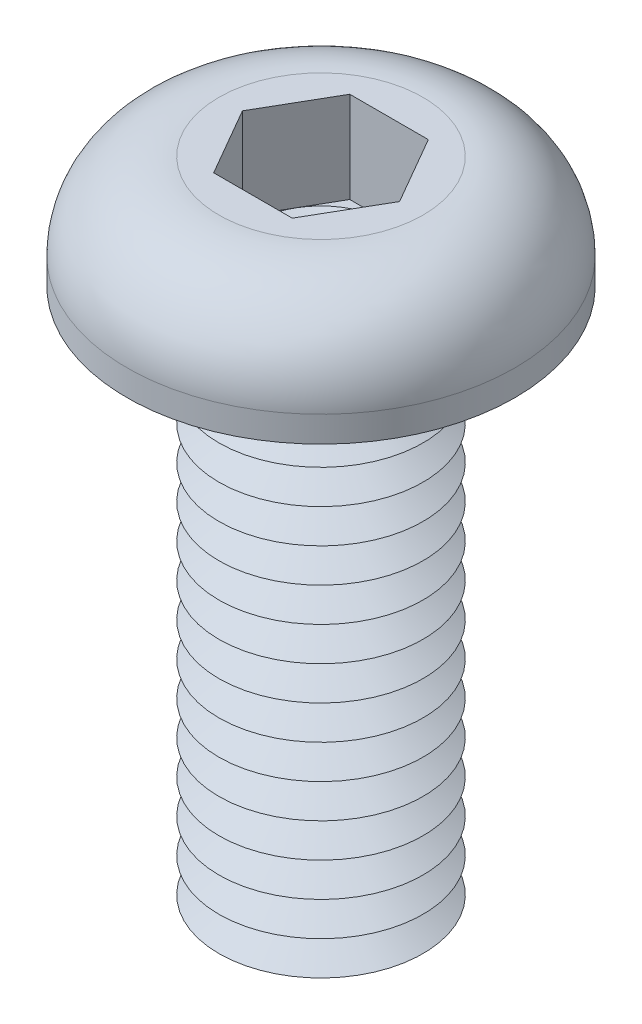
ISO-10303-21;
HEADER;
FILE_DESCRIPTION(('STEP AP214'),'2;1');
FILE_NAME('part.step','',(''),(''),'','','');
FILE_SCHEMA(('AUTOMOTIVE_DESIGN { 1 0 10303 214 1 1 1 1 }'));
ENDSEC;
DATA;
#1=APPLICATION_CONTEXT('core data for automotive mechanical design processes');
#2=APPLICATION_PROTOCOL_DEFINITION('international standard','automotive_design',2000,#1);
#3=PRODUCT_CONTEXT('',#1,'mechanical');
#4=PRODUCT('Part','Part','',(#3));
#5=PRODUCT_RELATED_PRODUCT_CATEGORY('part','',(#4));
#6=PRODUCT_DEFINITION_FORMATION('','',#4);
#7=PRODUCT_DEFINITION_CONTEXT('part definition',#1,'design');
#8=PRODUCT_DEFINITION('design','',#6,#7);
#9=PRODUCT_DEFINITION_SHAPE('','',#8);
#10=(LENGTH_UNIT() NAMED_UNIT(*) SI_UNIT(.MILLI.,.METRE.));
#11=(NAMED_UNIT(*) PLANE_ANGLE_UNIT() SI_UNIT($,.RADIAN.));
#12=(NAMED_UNIT(*) SI_UNIT($,.STERADIAN.) SOLID_ANGLE_UNIT());
#13=UNCERTAINTY_MEASURE_WITH_UNIT(LENGTH_MEASURE(1.E-05),#10,'distance_accuracy_value','');
#14=(GEOMETRIC_REPRESENTATION_CONTEXT(3) GLOBAL_UNCERTAINTY_ASSIGNED_CONTEXT((#13)) GLOBAL_UNIT_ASSIGNED_CONTEXT((#10,
#11,#12)) REPRESENTATION_CONTEXT('',''));
#15=CARTESIAN_POINT('',(0.,0.,0.));
#16=DIRECTION('',(0.,0.,1.));
#17=DIRECTION('',(1.,0.,0.));
#18=AXIS2_PLACEMENT_3D('',#15,#16,#17);
#19=CARTESIAN_POINT('',(0.,0.,0.));
#20=DIRECTION('',(0.,-1.,0.));
#21=DIRECTION('',(0.,0.,-1.));
#22=AXIS2_PLACEMENT_3D('',#19,#20,#21);
#23=TOROIDAL_SURFACE('',#22,1.75,0.25);
#24=CARTESIAN_POINT('',(0.,0.,-2.));
#25=VERTEX_POINT('',#24);
#26=VERTEX_LOOP('',#25);
#27=FACE_BOUND('',#26,.T.);
#28=ADVANCED_FACE('P0_F12',(#27),#23,.T.);
#29=CLOSED_SHELL('',(#28));
#30=MANIFOLD_SOLID_BREP('P0_B1',#29);
#31=CARTESIAN_POINT('',(0.577350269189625,0.31,-1.));
#32=DIRECTION('',(0.,1.,0.));
#33=DIRECTION('',(0.,0.,1.));
#34=AXIS2_PLACEMENT_3D('',#31,#32,#33);
#35=PLANE('',#34);
#36=CARTESIAN_POINT('',(0.,0.31,0.));
#37=DIRECTION('',(0.,1.,0.));
#38=DIRECTION('',(0.,0.,1.));
#39=AXIS2_PLACEMENT_3D('',#36,#37,#38);
#40=CIRCLE('',#39,1.);
#41=CARTESIAN_POINT('',(0.,0.31,1.));
#42=VERTEX_POINT('',#41);
#43=CARTESIAN_POINT('',(0.866025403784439,0.31,0.5));
#44=VERTEX_POINT('',#43);
#45=EDGE_CURVE('P1_E93',#42,#44,#40,.T.);
#46=ORIENTED_EDGE('',*,*,#45,.F.);
#47=DIRECTION('',(1.,0.,0.));
#48=VECTOR('',#47,1.);
#49=CARTESIAN_POINT('',(-0.577350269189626,0.31,1.));
#50=LINE('',#49,#48);
#51=CARTESIAN_POINT('',(0.577350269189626,0.31,1.));
#52=VERTEX_POINT('',#51);
#53=EDGE_CURVE('P1_E116',#42,#52,#50,.T.);
#54=ORIENTED_EDGE('',*,*,#53,.T.);
#55=DIRECTION('',(0.5,0.,-0.866025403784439));
#56=VECTOR('',#55,1.);
#57=CARTESIAN_POINT('',(0.577350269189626,0.31,1.));
#58=LINE('',#57,#56);
#59=EDGE_CURVE('P1_E112',#52,#44,#58,.T.);
#60=ORIENTED_EDGE('',*,*,#59,.T.);
#61=EDGE_LOOP('',(#46,#54,#60));
#62=FACE_BOUND('',#61,.T.);
#63=ADVANCED_FACE('P1_F15',(#62),#35,.T.);
#64=CARTESIAN_POINT('',(0.,0.31,0.));
#65=DIRECTION('',(0.,1.,0.));
#66=DIRECTION('',(0.,0.,1.));
#67=AXIS2_PLACEMENT_3D('',#64,#65,#66);
#68=CIRCLE('',#67,1.);
#69=CARTESIAN_POINT('',(0.866025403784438,0.31,-0.5));
#70=VERTEX_POINT('',#69);
#71=EDGE_CURVE('P1_E10',#44,#70,#68,.T.);
#72=ORIENTED_EDGE('',*,*,#71,.F.);
#73=CARTESIAN_POINT('',(1.15470053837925,0.31,0.));
#74=VERTEX_POINT('',#73);
#75=EDGE_CURVE('P1_E104',#44,#74,#58,.T.);
#76=ORIENTED_EDGE('',*,*,#75,.T.);
#77=DIRECTION('',(-0.5,0.,-0.866025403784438));
#78=VECTOR('',#77,1.);
#79=CARTESIAN_POINT('',(1.15470053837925,0.31,0.));
#80=LINE('',#79,#78);
#81=EDGE_CURVE('P1_E107',#74,#70,#80,.T.);
#82=ORIENTED_EDGE('',*,*,#81,.T.);
#83=EDGE_LOOP('',(#72,#76,#82));
#84=FACE_BOUND('',#83,.T.);
#85=ADVANCED_FACE('P1_F103',(#84),#35,.T.);
#86=CARTESIAN_POINT('',(0.,0.31,-1.));
#87=VERTEX_POINT('',#86);
#88=EDGE_CURVE('P1_E24',#70,#87,#68,.T.);
#89=ORIENTED_EDGE('',*,*,#88,.F.);
#90=CARTESIAN_POINT('',(0.577350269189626,0.31,-1.));
#91=VERTEX_POINT('',#90);
#92=EDGE_CURVE('P1_E139',#70,#91,#80,.T.);
#93=ORIENTED_EDGE('',*,*,#92,.T.);
#94=DIRECTION('',(-1.,0.,0.));
#95=VECTOR('',#94,1.);
#96=CARTESIAN_POINT('',(0.577350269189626,0.31,-1.));
#97=LINE('',#96,#95);
#98=EDGE_CURVE('P1_E312',#91,#87,#97,.T.);
#99=ORIENTED_EDGE('',*,*,#98,.T.);
#100=EDGE_LOOP('',(#89,#93,#99));
#101=FACE_BOUND('',#100,.T.);
#102=ADVANCED_FACE('P1_F277',(#101),#35,.T.);
#103=CARTESIAN_POINT('',(-0.866025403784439,0.31,-0.5));
#104=VERTEX_POINT('',#103);
#105=EDGE_CURVE('P1_E307',#87,#104,#68,.T.);
#106=ORIENTED_EDGE('',*,*,#105,.F.);
#107=CARTESIAN_POINT('',(-0.577350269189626,0.31,-1.));
#108=VERTEX_POINT('',#107);
#109=EDGE_CURVE('P1_E316',#87,#108,#97,.T.);
#110=ORIENTED_EDGE('',*,*,#109,.T.);
#111=DIRECTION('',(-0.5,0.,0.866025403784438));
#112=VECTOR('',#111,1.);
#113=CARTESIAN_POINT('',(-0.577350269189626,0.31,-1.));
#114=LINE('',#113,#112);
#115=EDGE_CURVE('P1_E311',#108,#104,#114,.T.);
#116=ORIENTED_EDGE('',*,*,#115,.T.);
#117=EDGE_LOOP('',(#106,#110,#116));
#118=FACE_BOUND('',#117,.T.);
#119=ADVANCED_FACE('P1_F291',(#118),#35,.T.);
#120=CARTESIAN_POINT('',(-0.866025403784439,0.31,0.5));
#121=VERTEX_POINT('',#120);
#122=EDGE_CURVE('P1_E31',#104,#121,#68,.T.);
#123=ORIENTED_EDGE('',*,*,#122,.F.);
#124=CARTESIAN_POINT('',(-1.15470053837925,0.31,0.));
#125=VERTEX_POINT('',#124);
#126=EDGE_CURVE('P1_E303',#104,#125,#114,.T.);
#127=ORIENTED_EDGE('',*,*,#126,.T.);
#128=DIRECTION('',(0.5,0.,0.866025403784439));
#129=VECTOR('',#128,1.);
#130=CARTESIAN_POINT('',(-1.15470053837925,0.31,0.));
#131=LINE('',#130,#129);
#132=EDGE_CURVE('P1_E306',#125,#121,#131,.T.);
#133=ORIENTED_EDGE('',*,*,#132,.T.);
#134=EDGE_LOOP('',(#123,#127,#133));
#135=FACE_BOUND('',#134,.T.);
#136=ADVANCED_FACE('P1_F282',(#135),#35,.T.);
#137=CARTESIAN_POINT('',(0.,-7.5,0.));
#138=DIRECTION('',(0.,1.,0.));
#139=DIRECTION('',(0.,0.,1.));
#140=AXIS2_PLACEMENT_3D('',#137,#138,#139);
#141=CONICAL_SURFACE('',#140,1.06698729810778,1.0471975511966);
#142=CARTESIAN_POINT('',(0.,-7.25,0.));
#143=DIRECTION('',(0.,-1.,0.));
#144=DIRECTION('',(0.,0.,-1.));
#145=AXIS2_PLACEMENT_3D('',#142,#143,#144);
#146=CIRCLE('',#145,1.5);
#147=CARTESIAN_POINT('',(0.,-7.25,-1.5));
#148=VERTEX_POINT('',#147);
#149=EDGE_CURVE('P1_E239',#148,#148,#146,.T.);
#150=ORIENTED_EDGE('',*,*,#149,.T.);
#151=EDGE_LOOP('',(#150));
#152=FACE_BOUND('',#151,.T.);
#153=CARTESIAN_POINT('',(0.,-7.5,0.));
#154=DIRECTION('',(0.,-1.,0.));
#155=DIRECTION('',(0.,0.,-1.));
#156=AXIS2_PLACEMENT_3D('',#153,#154,#155);
#157=CIRCLE('',#156,1.06698729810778);
#158=CARTESIAN_POINT('',(0.,-7.5,-1.06698729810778));
#159=VERTEX_POINT('',#158);
#160=EDGE_CURVE('P1_E242',#159,#159,#157,.T.);
#161=ORIENTED_EDGE('',*,*,#160,.F.);
#162=EDGE_LOOP('',(#161));
#163=FACE_BOUND('',#162,.T.);
#164=ADVANCED_FACE('P1_F290',(#152,#163),#141,.T.);
#165=CARTESIAN_POINT('',(0.,-7.75,0.));
#166=DIRECTION('',(0.,-1.,0.));
#167=DIRECTION('',(0.,0.,-1.));
#168=AXIS2_PLACEMENT_3D('',#165,#166,#167);
#169=CONICAL_SURFACE('',#168,1.5,1.0471975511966);
#170=ORIENTED_EDGE('',*,*,#160,.T.);
#171=EDGE_LOOP('',(#170));
#172=FACE_BOUND('',#171,.T.);
#173=CARTESIAN_POINT('',(0.,-7.75,0.));
#174=DIRECTION('',(0.,-1.,0.));
#175=DIRECTION('',(0.,0.,-1.));
#176=AXIS2_PLACEMENT_3D('',#173,#174,#175);
#177=CIRCLE('',#176,1.5);
#178=CARTESIAN_POINT('',(0.,-7.75,-1.5));
#179=VERTEX_POINT('',#178);
#180=EDGE_CURVE('P1_E245',#179,#179,#177,.T.);
#181=ORIENTED_EDGE('',*,*,#180,.F.);
#182=EDGE_LOOP('',(#181));
#183=FACE_BOUND('',#182,.T.);
#184=ADVANCED_FACE('P1_F297',(#172,#183),#169,.T.);
#185=CARTESIAN_POINT('',(0.,-8.,0.));
#186=DIRECTION('',(0.,1.,0.));
#187=DIRECTION('',(0.,0.,1.));
#188=AXIS2_PLACEMENT_3D('',#185,#186,#187);
#189=PLANE('',#188);
#190=CARTESIAN_POINT('',(0.,-8.,0.));
#191=DIRECTION('',(0.,-1.,0.));
#192=DIRECTION('',(0.,0.,-1.));
#193=AXIS2_PLACEMENT_3D('',#190,#191,#192);
#194=CIRCLE('',#193,1.06698729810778);
#195=CARTESIAN_POINT('',(0.,-8.,-1.06698729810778));
#196=VERTEX_POINT('',#195);
#197=EDGE_CURVE('P1_E248',#196,#196,#194,.T.);
#198=ORIENTED_EDGE('',*,*,#197,.T.);
#199=EDGE_LOOP('',(#198));
#200=FACE_BOUND('',#199,.T.);
#201=ADVANCED_FACE('P1_F375',(#200),#189,.F.);
#202=CARTESIAN_POINT('',(0.,-8.,0.));
#203=DIRECTION('',(0.,1.,0.));
#204=DIRECTION('',(0.,0.,1.));
#205=AXIS2_PLACEMENT_3D('',#202,#203,#204);
#206=CONICAL_SURFACE('',#205,1.06698729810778,1.0471975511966);
#207=ORIENTED_EDGE('',*,*,#180,.T.);
#208=EDGE_LOOP('',(#207));
#209=FACE_BOUND('',#208,.T.);
#210=ORIENTED_EDGE('',*,*,#197,.F.);
#211=EDGE_LOOP('',(#210));
#212=FACE_BOUND('',#211,.T.);
#213=ADVANCED_FACE('P1_F386',(#209,#212),#206,.T.);
#214=CARTESIAN_POINT('',(0.,-7.,0.));
#215=DIRECTION('',(0.,1.,0.));
#216=DIRECTION('',(0.,0.,1.));
#217=AXIS2_PLACEMENT_3D('',#214,#215,#216);
#218=CONICAL_SURFACE('',#217,1.06698729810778,1.0471975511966);
#219=CARTESIAN_POINT('',(0.,-6.75,0.));
#220=DIRECTION('',(0.,-1.,0.));
#221=DIRECTION('',(0.,0.,-1.));
#222=AXIS2_PLACEMENT_3D('',#219,#220,#221);
#223=CIRCLE('',#222,1.5);
#224=CARTESIAN_POINT('',(0.,-6.75,-1.5));
#225=VERTEX_POINT('',#224);
#226=EDGE_CURVE('P1_E233',#225,#225,#223,.T.);
#227=ORIENTED_EDGE('',*,*,#226,.T.);
#228=EDGE_LOOP('',(#227));
#229=FACE_BOUND('',#228,.T.);
#230=CARTESIAN_POINT('',(0.,-7.,0.));
#231=DIRECTION('',(0.,-1.,0.));
#232=DIRECTION('',(0.,0.,-1.));
#233=AXIS2_PLACEMENT_3D('',#230,#231,#232);
#234=CIRCLE('',#233,1.06698729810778);
#235=CARTESIAN_POINT('',(0.,-7.,-1.06698729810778));
#236=VERTEX_POINT('',#235);
#237=EDGE_CURVE('P1_E236',#236,#236,#234,.T.);
#238=ORIENTED_EDGE('',*,*,#237,.F.);
#239=EDGE_LOOP('',(#238));
#240=FACE_BOUND('',#239,.T.);
#241=ADVANCED_FACE('P1_F395',(#229,#240),#218,.T.);
#242=CARTESIAN_POINT('',(0.,-7.25,0.));
#243=DIRECTION('',(0.,-1.,0.));
#244=DIRECTION('',(0.,0.,-1.));
#245=AXIS2_PLACEMENT_3D('',#242,#243,#244);
#246=CONICAL_SURFACE('',#245,1.5,1.0471975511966);
#247=ORIENTED_EDGE('',*,*,#237,.T.);
#248=EDGE_LOOP('',(#247));
#249=FACE_BOUND('',#248,.T.);
#250=ORIENTED_EDGE('',*,*,#149,.F.);
#251=EDGE_LOOP('',(#250));
#252=FACE_BOUND('',#251,.T.);
#253=ADVANCED_FACE('P1_F404',(#249,#252),#246,.T.);
#254=CARTESIAN_POINT('',(0.,-6.5,0.));
#255=DIRECTION('',(0.,1.,0.));
#256=DIRECTION('',(0.,0.,1.));
#257=AXIS2_PLACEMENT_3D('',#254,#255,#256);
#258=CONICAL_SURFACE('',#257,1.06698729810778,1.0471975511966);
#259=CARTESIAN_POINT('',(0.,-6.25,0.));
#260=DIRECTION('',(0.,-1.,0.));
#261=DIRECTION('',(0.,0.,-1.));
#262=AXIS2_PLACEMENT_3D('',#259,#260,#261);
#263=CIRCLE('',#262,1.5);
#264=CARTESIAN_POINT('',(0.,-6.25,-1.5));
#265=VERTEX_POINT('',#264);
#266=EDGE_CURVE('P1_E227',#265,#265,#263,.T.);
#267=ORIENTED_EDGE('',*,*,#266,.T.);
#268=EDGE_LOOP('',(#267));
#269=FACE_BOUND('',#268,.T.);
#270=CARTESIAN_POINT('',(0.,-6.5,0.));
#271=DIRECTION('',(0.,-1.,0.));
#272=DIRECTION('',(0.,0.,-1.));
#273=AXIS2_PLACEMENT_3D('',#270,#271,#272);
#274=CIRCLE('',#273,1.06698729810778);
#275=CARTESIAN_POINT('',(0.,-6.5,-1.06698729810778));
#276=VERTEX_POINT('',#275);
#277=EDGE_CURVE('P1_E230',#276,#276,#274,.T.);
#278=ORIENTED_EDGE('',*,*,#277,.F.);
#279=EDGE_LOOP('',(#278));
#280=FACE_BOUND('',#279,.T.);
#281=ADVANCED_FACE('P1_F414',(#269,#280),#258,.T.);
#282=CARTESIAN_POINT('',(0.,-6.75,0.));
#283=DIRECTION('',(0.,-1.,0.));
#284=DIRECTION('',(0.,0.,-1.));
#285=AXIS2_PLACEMENT_3D('',#282,#283,#284);
#286=CONICAL_SURFACE('',#285,1.5,1.0471975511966);
#287=ORIENTED_EDGE('',*,*,#277,.T.);
#288=EDGE_LOOP('',(#287));
#289=FACE_BOUND('',#288,.T.);
#290=ORIENTED_EDGE('',*,*,#226,.F.);
#291=EDGE_LOOP('',(#290));
#292=FACE_BOUND('',#291,.T.);
#293=ADVANCED_FACE('P1_F424',(#289,#292),#286,.T.);
#294=CARTESIAN_POINT('',(0.,-6.,0.));
#295=DIRECTION('',(0.,1.,0.));
#296=DIRECTION('',(0.,0.,1.));
#297=AXIS2_PLACEMENT_3D('',#294,#295,#296);
#298=CONICAL_SURFACE('',#297,1.06698729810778,1.0471975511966);
#299=CARTESIAN_POINT('',(0.,-5.75,0.));
#300=DIRECTION('',(0.,-1.,0.));
#301=DIRECTION('',(0.,0.,-1.));
#302=AXIS2_PLACEMENT_3D('',#299,#300,#301);
#303=CIRCLE('',#302,1.5);
#304=CARTESIAN_POINT('',(0.,-5.75,-1.5));
#305=VERTEX_POINT('',#304);
#306=EDGE_CURVE('P1_E221',#305,#305,#303,.T.);
#307=ORIENTED_EDGE('',*,*,#306,.T.);
#308=EDGE_LOOP('',(#307));
#309=FACE_BOUND('',#308,.T.);
#310=CARTESIAN_POINT('',(0.,-6.,0.));
#311=DIRECTION('',(0.,-1.,0.));
#312=DIRECTION('',(0.,0.,-1.));
#313=AXIS2_PLACEMENT_3D('',#310,#311,#312);
#314=CIRCLE('',#313,1.06698729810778);
#315=CARTESIAN_POINT('',(0.,-6.,-1.06698729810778));
#316=VERTEX_POINT('',#315);
#317=EDGE_CURVE('P1_E224',#316,#316,#314,.T.);
#318=ORIENTED_EDGE('',*,*,#317,.F.);
#319=EDGE_LOOP('',(#318));
#320=FACE_BOUND('',#319,.T.);
#321=ADVANCED_FACE('P1_F434',(#309,#320),#298,.T.);
#322=CARTESIAN_POINT('',(0.,-6.25,0.));
#323=DIRECTION('',(0.,-1.,0.));
#324=DIRECTION('',(0.,0.,-1.));
#325=AXIS2_PLACEMENT_3D('',#322,#323,#324);
#326=CONICAL_SURFACE('',#325,1.5,1.0471975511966);
#327=ORIENTED_EDGE('',*,*,#317,.T.);
#328=EDGE_LOOP('',(#327));
#329=FACE_BOUND('',#328,.T.);
#330=ORIENTED_EDGE('',*,*,#266,.F.);
#331=EDGE_LOOP('',(#330));
#332=FACE_BOUND('',#331,.T.);
#333=ADVANCED_FACE('P1_F444',(#329,#332),#326,.T.);
#334=CARTESIAN_POINT('',(0.,-5.5,0.));
#335=DIRECTION('',(0.,1.,0.));
#336=DIRECTION('',(0.,0.,1.));
#337=AXIS2_PLACEMENT_3D('',#334,#335,#336);
#338=CONICAL_SURFACE('',#337,1.06698729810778,1.0471975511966);
#339=CARTESIAN_POINT('',(0.,-5.25,0.));
#340=DIRECTION('',(0.,-1.,0.));
#341=DIRECTION('',(0.,0.,-1.));
#342=AXIS2_PLACEMENT_3D('',#339,#340,#341);
#343=CIRCLE('',#342,1.5);
#344=CARTESIAN_POINT('',(0.,-5.25,-1.5));
#345=VERTEX_POINT('',#344);
#346=EDGE_CURVE('P1_E215',#345,#345,#343,.T.);
#347=ORIENTED_EDGE('',*,*,#346,.T.);
#348=EDGE_LOOP('',(#347));
#349=FACE_BOUND('',#348,.T.);
#350=CARTESIAN_POINT('',(0.,-5.5,0.));
#351=DIRECTION('',(0.,-1.,0.));
#352=DIRECTION('',(0.,0.,-1.));
#353=AXIS2_PLACEMENT_3D('',#350,#351,#352);
#354=CIRCLE('',#353,1.06698729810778);
#355=CARTESIAN_POINT('',(0.,-5.5,-1.06698729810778));
#356=VERTEX_POINT('',#355);
#357=EDGE_CURVE('P1_E218',#356,#356,#354,.T.);
#358=ORIENTED_EDGE('',*,*,#357,.F.);
#359=EDGE_LOOP('',(#358));
#360=FACE_BOUND('',#359,.T.);
#361=ADVANCED_FACE('P1_F454',(#349,#360),#338,.T.);
#362=CARTESIAN_POINT('',(0.,-5.75,0.));
#363=DIRECTION('',(0.,-1.,0.));
#364=DIRECTION('',(0.,0.,-1.));
#365=AXIS2_PLACEMENT_3D('',#362,#363,#364);
#366=CONICAL_SURFACE('',#365,1.5,1.0471975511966);
#367=ORIENTED_EDGE('',*,*,#357,.T.);
#368=EDGE_LOOP('',(#367));
#369=FACE_BOUND('',#368,.T.);
#370=ORIENTED_EDGE('',*,*,#306,.F.);
#371=EDGE_LOOP('',(#370));
#372=FACE_BOUND('',#371,.T.);
#373=ADVANCED_FACE('P1_F464',(#369,#372),#366,.T.);
#374=CARTESIAN_POINT('',(0.,-5.,0.));
#375=DIRECTION('',(0.,1.,0.));
#376=DIRECTION('',(0.,0.,1.));
#377=AXIS2_PLACEMENT_3D('',#374,#375,#376);
#378=CONICAL_SURFACE('',#377,1.06698729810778,1.0471975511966);
#379=CARTESIAN_POINT('',(0.,-4.75,0.));
#380=DIRECTION('',(0.,-1.,0.));
#381=DIRECTION('',(0.,0.,-1.));
#382=AXIS2_PLACEMENT_3D('',#379,#380,#381);
#383=CIRCLE('',#382,1.5);
#384=CARTESIAN_POINT('',(0.,-4.75,-1.5));
#385=VERTEX_POINT('',#384);
#386=EDGE_CURVE('P1_E209',#385,#385,#383,.T.);
#387=ORIENTED_EDGE('',*,*,#386,.T.);
#388=EDGE_LOOP('',(#387));
#389=FACE_BOUND('',#388,.T.);
#390=CARTESIAN_POINT('',(0.,-5.,0.));
#391=DIRECTION('',(0.,-1.,0.));
#392=DIRECTION('',(0.,0.,-1.));
#393=AXIS2_PLACEMENT_3D('',#390,#391,#392);
#394=CIRCLE('',#393,1.06698729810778);
#395=CARTESIAN_POINT('',(0.,-5.,-1.06698729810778));
#396=VERTEX_POINT('',#395);
#397=EDGE_CURVE('P1_E212',#396,#396,#394,.T.);
#398=ORIENTED_EDGE('',*,*,#397,.F.);
#399=EDGE_LOOP('',(#398));
#400=FACE_BOUND('',#399,.T.);
#401=ADVANCED_FACE('P1_F474',(#389,#400),#378,.T.);
#402=CARTESIAN_POINT('',(0.,-5.25,0.));
#403=DIRECTION('',(0.,-1.,0.));
#404=DIRECTION('',(0.,0.,-1.));
#405=AXIS2_PLACEMENT_3D('',#402,#403,#404);
#406=CONICAL_SURFACE('',#405,1.5,1.0471975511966);
#407=ORIENTED_EDGE('',*,*,#397,.T.);
#408=EDGE_LOOP('',(#407));
#409=FACE_BOUND('',#408,.T.);
#410=ORIENTED_EDGE('',*,*,#346,.F.);
#411=EDGE_LOOP('',(#410));
#412=FACE_BOUND('',#411,.T.);
#413=ADVANCED_FACE('P1_F484',(#409,#412),#406,.T.);
#414=CARTESIAN_POINT('',(0.,-4.5,0.));
#415=DIRECTION('',(0.,1.,0.));
#416=DIRECTION('',(0.,0.,1.));
#417=AXIS2_PLACEMENT_3D('',#414,#415,#416);
#418=CONICAL_SURFACE('',#417,1.06698729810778,1.0471975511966);
#419=CARTESIAN_POINT('',(0.,-4.25,0.));
#420=DIRECTION('',(0.,-1.,0.));
#421=DIRECTION('',(0.,0.,-1.));
#422=AXIS2_PLACEMENT_3D('',#419,#420,#421);
#423=CIRCLE('',#422,1.5);
#424=CARTESIAN_POINT('',(0.,-4.25,-1.5));
#425=VERTEX_POINT('',#424);
#426=EDGE_CURVE('P1_E203',#425,#425,#423,.T.);
#427=ORIENTED_EDGE('',*,*,#426,.T.);
#428=EDGE_LOOP('',(#427));
#429=FACE_BOUND('',#428,.T.);
#430=CARTESIAN_POINT('',(0.,-4.5,0.));
#431=DIRECTION('',(0.,-1.,0.));
#432=DIRECTION('',(0.,0.,-1.));
#433=AXIS2_PLACEMENT_3D('',#430,#431,#432);
#434=CIRCLE('',#433,1.06698729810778);
#435=CARTESIAN_POINT('',(0.,-4.5,-1.06698729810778));
#436=VERTEX_POINT('',#435);
#437=EDGE_CURVE('P1_E206',#436,#436,#434,.T.);
#438=ORIENTED_EDGE('',*,*,#437,.F.);
#439=EDGE_LOOP('',(#438));
#440=FACE_BOUND('',#439,.T.);
#441=ADVANCED_FACE('P1_F494',(#429,#440),#418,.T.);
#442=CARTESIAN_POINT('',(0.,-4.75,0.));
#443=DIRECTION('',(0.,-1.,0.));
#444=DIRECTION('',(0.,0.,-1.));
#445=AXIS2_PLACEMENT_3D('',#442,#443,#444);
#446=CONICAL_SURFACE('',#445,1.5,1.0471975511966);
#447=ORIENTED_EDGE('',*,*,#437,.T.);
#448=EDGE_LOOP('',(#447));
#449=FACE_BOUND('',#448,.T.);
#450=ORIENTED_EDGE('',*,*,#386,.F.);
#451=EDGE_LOOP('',(#450));
#452=FACE_BOUND('',#451,.T.);
#453=ADVANCED_FACE('P1_F504',(#449,#452),#446,.T.);
#454=CARTESIAN_POINT('',(0.,-4.,0.));
#455=DIRECTION('',(0.,1.,0.));
#456=DIRECTION('',(0.,0.,1.));
#457=AXIS2_PLACEMENT_3D('',#454,#455,#456);
#458=CONICAL_SURFACE('',#457,1.06698729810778,1.0471975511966);
#459=CARTESIAN_POINT('',(0.,-3.75,0.));
#460=DIRECTION('',(0.,-1.,0.));
#461=DIRECTION('',(0.,0.,-1.));
#462=AXIS2_PLACEMENT_3D('',#459,#460,#461);
#463=CIRCLE('',#462,1.5);
#464=CARTESIAN_POINT('',(0.,-3.75,-1.5));
#465=VERTEX_POINT('',#464);
#466=EDGE_CURVE('P1_E197',#465,#465,#463,.T.);
#467=ORIENTED_EDGE('',*,*,#466,.T.);
#468=EDGE_LOOP('',(#467));
#469=FACE_BOUND('',#468,.T.);
#470=CARTESIAN_POINT('',(0.,-4.,0.));
#471=DIRECTION('',(0.,-1.,0.));
#472=DIRECTION('',(0.,0.,-1.));
#473=AXIS2_PLACEMENT_3D('',#470,#471,#472);
#474=CIRCLE('',#473,1.06698729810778);
#475=CARTESIAN_POINT('',(0.,-4.,-1.06698729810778));
#476=VERTEX_POINT('',#475);
#477=EDGE_CURVE('P1_E200',#476,#476,#474,.T.);
#478=ORIENTED_EDGE('',*,*,#477,.F.);
#479=EDGE_LOOP('',(#478));
#480=FACE_BOUND('',#479,.T.);
#481=ADVANCED_FACE('P1_F514',(#469,#480),#458,.T.);
#482=CARTESIAN_POINT('',(0.,-4.25,0.));
#483=DIRECTION('',(0.,-1.,0.));
#484=DIRECTION('',(0.,0.,-1.));
#485=AXIS2_PLACEMENT_3D('',#482,#483,#484);
#486=CONICAL_SURFACE('',#485,1.5,1.0471975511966);
#487=ORIENTED_EDGE('',*,*,#477,.T.);
#488=EDGE_LOOP('',(#487));
#489=FACE_BOUND('',#488,.T.);
#490=ORIENTED_EDGE('',*,*,#426,.F.);
#491=EDGE_LOOP('',(#490));
#492=FACE_BOUND('',#491,.T.);
#493=ADVANCED_FACE('P1_F524',(#489,#492),#486,.T.);
#494=CARTESIAN_POINT('',(0.,-3.5,0.));
#495=DIRECTION('',(0.,1.,0.));
#496=DIRECTION('',(0.,0.,1.));
#497=AXIS2_PLACEMENT_3D('',#494,#495,#496);
#498=CONICAL_SURFACE('',#497,1.06698729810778,1.0471975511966);
#499=CARTESIAN_POINT('',(0.,-3.25,0.));
#500=DIRECTION('',(0.,-1.,0.));
#501=DIRECTION('',(0.,0.,-1.));
#502=AXIS2_PLACEMENT_3D('',#499,#500,#501);
#503=CIRCLE('',#502,1.5);
#504=CARTESIAN_POINT('',(0.,-3.25,-1.5));
#505=VERTEX_POINT('',#504);
#506=EDGE_CURVE('P1_E191',#505,#505,#503,.T.);
#507=ORIENTED_EDGE('',*,*,#506,.T.);
#508=EDGE_LOOP('',(#507));
#509=FACE_BOUND('',#508,.T.);
#510=CARTESIAN_POINT('',(0.,-3.5,0.));
#511=DIRECTION('',(0.,-1.,0.));
#512=DIRECTION('',(0.,0.,-1.));
#513=AXIS2_PLACEMENT_3D('',#510,#511,#512);
#514=CIRCLE('',#513,1.06698729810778);
#515=CARTESIAN_POINT('',(0.,-3.5,-1.06698729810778));
#516=VERTEX_POINT('',#515);
#517=EDGE_CURVE('P1_E194',#516,#516,#514,.T.);
#518=ORIENTED_EDGE('',*,*,#517,.F.);
#519=EDGE_LOOP('',(#518));
#520=FACE_BOUND('',#519,.T.);
#521=ADVANCED_FACE('P1_F534',(#509,#520),#498,.T.);
#522=CARTESIAN_POINT('',(0.,-3.75,0.));
#523=DIRECTION('',(0.,-1.,0.));
#524=DIRECTION('',(0.,0.,-1.));
#525=AXIS2_PLACEMENT_3D('',#522,#523,#524);
#526=CONICAL_SURFACE('',#525,1.5,1.0471975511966);
#527=ORIENTED_EDGE('',*,*,#517,.T.);
#528=EDGE_LOOP('',(#527));
#529=FACE_BOUND('',#528,.T.);
#530=ORIENTED_EDGE('',*,*,#466,.F.);
#531=EDGE_LOOP('',(#530));
#532=FACE_BOUND('',#531,.T.);
#533=ADVANCED_FACE('P1_F544',(#529,#532),#526,.T.);
#534=CARTESIAN_POINT('',(0.,-3.,0.));
#535=DIRECTION('',(0.,1.,0.));
#536=DIRECTION('',(0.,0.,1.));
#537=AXIS2_PLACEMENT_3D('',#534,#535,#536);
#538=CONICAL_SURFACE('',#537,1.06698729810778,1.0471975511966);
#539=CARTESIAN_POINT('',(0.,-2.75,0.));
#540=DIRECTION('',(0.,-1.,0.));
#541=DIRECTION('',(0.,0.,-1.));
#542=AXIS2_PLACEMENT_3D('',#539,#540,#541);
#543=CIRCLE('',#542,1.5);
#544=CARTESIAN_POINT('',(0.,-2.75,-1.5));
#545=VERTEX_POINT('',#544);
#546=EDGE_CURVE('P1_E185',#545,#545,#543,.T.);
#547=ORIENTED_EDGE('',*,*,#546,.T.);
#548=EDGE_LOOP('',(#547));
#549=FACE_BOUND('',#548,.T.);
#550=CARTESIAN_POINT('',(0.,-3.,0.));
#551=DIRECTION('',(0.,-1.,0.));
#552=DIRECTION('',(0.,0.,-1.));
#553=AXIS2_PLACEMENT_3D('',#550,#551,#552);
#554=CIRCLE('',#553,1.06698729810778);
#555=CARTESIAN_POINT('',(0.,-3.,-1.06698729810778));
#556=VERTEX_POINT('',#555);
#557=EDGE_CURVE('P1_E188',#556,#556,#554,.T.);
#558=ORIENTED_EDGE('',*,*,#557,.F.);
#559=EDGE_LOOP('',(#558));
#560=FACE_BOUND('',#559,.T.);
#561=ADVANCED_FACE('P1_F554',(#549,#560),#538,.T.);
#562=CARTESIAN_POINT('',(0.,-3.25,0.));
#563=DIRECTION('',(0.,-1.,0.));
#564=DIRECTION('',(0.,0.,-1.));
#565=AXIS2_PLACEMENT_3D('',#562,#563,#564);
#566=CONICAL_SURFACE('',#565,1.5,1.0471975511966);
#567=ORIENTED_EDGE('',*,*,#557,.T.);
#568=EDGE_LOOP('',(#567));
#569=FACE_BOUND('',#568,.T.);
#570=ORIENTED_EDGE('',*,*,#506,.F.);
#571=EDGE_LOOP('',(#570));
#572=FACE_BOUND('',#571,.T.);
#573=ADVANCED_FACE('P1_F564',(#569,#572),#566,.T.);
#574=CARTESIAN_POINT('',(0.,-2.5,0.));
#575=DIRECTION('',(0.,1.,0.));
#576=DIRECTION('',(0.,0.,1.));
#577=AXIS2_PLACEMENT_3D('',#574,#575,#576);
#578=CONICAL_SURFACE('',#577,1.06698729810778,1.0471975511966);
#579=CARTESIAN_POINT('',(0.,-2.25,0.));
#580=DIRECTION('',(0.,-1.,0.));
#581=DIRECTION('',(0.,0.,-1.));
#582=AXIS2_PLACEMENT_3D('',#579,#580,#581);
#583=CIRCLE('',#582,1.5);
#584=CARTESIAN_POINT('',(0.,-2.25,-1.5));
#585=VERTEX_POINT('',#584);
#586=EDGE_CURVE('P1_E179',#585,#585,#583,.T.);
#587=ORIENTED_EDGE('',*,*,#586,.T.);
#588=EDGE_LOOP('',(#587));
#589=FACE_BOUND('',#588,.T.);
#590=CARTESIAN_POINT('',(0.,-2.5,0.));
#591=DIRECTION('',(0.,-1.,0.));
#592=DIRECTION('',(0.,0.,-1.));
#593=AXIS2_PLACEMENT_3D('',#590,#591,#592);
#594=CIRCLE('',#593,1.06698729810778);
#595=CARTESIAN_POINT('',(0.,-2.5,-1.06698729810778));
#596=VERTEX_POINT('',#595);
#597=EDGE_CURVE('P1_E182',#596,#596,#594,.T.);
#598=ORIENTED_EDGE('',*,*,#597,.F.);
#599=EDGE_LOOP('',(#598));
#600=FACE_BOUND('',#599,.T.);
#601=ADVANCED_FACE('P1_F574',(#589,#600),#578,.T.);
#602=CARTESIAN_POINT('',(0.,-2.75,0.));
#603=DIRECTION('',(0.,-1.,0.));
#604=DIRECTION('',(0.,0.,-1.));
#605=AXIS2_PLACEMENT_3D('',#602,#603,#604);
#606=CONICAL_SURFACE('',#605,1.5,1.0471975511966);
#607=ORIENTED_EDGE('',*,*,#597,.T.);
#608=EDGE_LOOP('',(#607));
#609=FACE_BOUND('',#608,.T.);
#610=ORIENTED_EDGE('',*,*,#546,.F.);
#611=EDGE_LOOP('',(#610));
#612=FACE_BOUND('',#611,.T.);
#613=ADVANCED_FACE('P1_F584',(#609,#612),#606,.T.);
#614=CARTESIAN_POINT('',(0.,-2.,0.));
#615=DIRECTION('',(0.,1.,0.));
#616=DIRECTION('',(0.,0.,1.));
#617=AXIS2_PLACEMENT_3D('',#614,#615,#616);
#618=CONICAL_SURFACE('',#617,1.06698729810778,1.0471975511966);
#619=CARTESIAN_POINT('',(0.,-1.75,0.));
#620=DIRECTION('',(0.,-1.,0.));
#621=DIRECTION('',(0.,0.,-1.));
#622=AXIS2_PLACEMENT_3D('',#619,#620,#621);
#623=CIRCLE('',#622,1.5);
#624=CARTESIAN_POINT('',(0.,-1.75,-1.5));
#625=VERTEX_POINT('',#624);
#626=EDGE_CURVE('P1_E173',#625,#625,#623,.T.);
#627=ORIENTED_EDGE('',*,*,#626,.T.);
#628=EDGE_LOOP('',(#627));
#629=FACE_BOUND('',#628,.T.);
#630=CARTESIAN_POINT('',(0.,-2.,0.));
#631=DIRECTION('',(0.,-1.,0.));
#632=DIRECTION('',(0.,0.,-1.));
#633=AXIS2_PLACEMENT_3D('',#630,#631,#632);
#634=CIRCLE('',#633,1.06698729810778);
#635=CARTESIAN_POINT('',(0.,-2.,-1.06698729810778));
#636=VERTEX_POINT('',#635);
#637=EDGE_CURVE('P1_E176',#636,#636,#634,.T.);
#638=ORIENTED_EDGE('',*,*,#637,.F.);
#639=EDGE_LOOP('',(#638));
#640=FACE_BOUND('',#639,.T.);
#641=ADVANCED_FACE('P1_F594',(#629,#640),#618,.T.);
#642=CARTESIAN_POINT('',(0.,-2.25,0.));
#643=DIRECTION('',(0.,-1.,0.));
#644=DIRECTION('',(0.,0.,-1.));
#645=AXIS2_PLACEMENT_3D('',#642,#643,#644);
#646=CONICAL_SURFACE('',#645,1.5,1.0471975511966);
#647=ORIENTED_EDGE('',*,*,#637,.T.);
#648=EDGE_LOOP('',(#647));
#649=FACE_BOUND('',#648,.T.);
#650=ORIENTED_EDGE('',*,*,#586,.F.);
#651=EDGE_LOOP('',(#650));
#652=FACE_BOUND('',#651,.T.);
#653=ADVANCED_FACE('P1_F604',(#649,#652),#646,.T.);
#654=CARTESIAN_POINT('',(0.,-1.5,0.));
#655=DIRECTION('',(0.,1.,0.));
#656=DIRECTION('',(0.,0.,1.));
#657=AXIS2_PLACEMENT_3D('',#654,#655,#656);
#658=CONICAL_SURFACE('',#657,1.06698729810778,1.0471975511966);
#659=CARTESIAN_POINT('',(0.,-1.25,0.));
#660=DIRECTION('',(0.,-1.,0.));
#661=DIRECTION('',(0.,0.,-1.));
#662=AXIS2_PLACEMENT_3D('',#659,#660,#661);
#663=CIRCLE('',#662,1.5);
#664=CARTESIAN_POINT('',(0.,-1.25,-1.5));
#665=VERTEX_POINT('',#664);
#666=EDGE_CURVE('P1_E164',#665,#665,#663,.T.);
#667=ORIENTED_EDGE('',*,*,#666,.T.);
#668=EDGE_LOOP('',(#667));
#669=FACE_BOUND('',#668,.T.);
#670=CARTESIAN_POINT('',(0.,-1.5,0.));
#671=DIRECTION('',(0.,-1.,0.));
#672=DIRECTION('',(0.,0.,-1.));
#673=AXIS2_PLACEMENT_3D('',#670,#671,#672);
#674=CIRCLE('',#673,1.06698729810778);
#675=CARTESIAN_POINT('',(0.,-1.5,-1.06698729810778));
#676=VERTEX_POINT('',#675);
#677=EDGE_CURVE('P1_E170',#676,#676,#674,.T.);
#678=ORIENTED_EDGE('',*,*,#677,.F.);
#679=EDGE_LOOP('',(#678));
#680=FACE_BOUND('',#679,.T.);
#681=ADVANCED_FACE('P1_F614',(#669,#680),#658,.T.);
#682=CARTESIAN_POINT('',(0.,-1.75,0.));
#683=DIRECTION('',(0.,-1.,0.));
#684=DIRECTION('',(0.,0.,-1.));
#685=AXIS2_PLACEMENT_3D('',#682,#683,#684);
#686=CONICAL_SURFACE('',#685,1.5,1.0471975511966);
#687=ORIENTED_EDGE('',*,*,#677,.T.);
#688=EDGE_LOOP('',(#687));
#689=FACE_BOUND('',#688,.T.);
#690=ORIENTED_EDGE('',*,*,#626,.F.);
#691=EDGE_LOOP('',(#690));
#692=FACE_BOUND('',#691,.T.);
#693=ADVANCED_FACE('P1_F624',(#689,#692),#686,.T.);
#694=CARTESIAN_POINT('',(0.,-1.,0.));
#695=DIRECTION('',(0.,1.,0.));
#696=DIRECTION('',(0.,0.,1.));
#697=AXIS2_PLACEMENT_3D('',#694,#695,#696);
#698=CONICAL_SURFACE('',#697,1.06698729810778,1.0471975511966);
#699=CARTESIAN_POINT('',(0.,-0.75,0.));
#700=DIRECTION('',(0.,-1.,0.));
#701=DIRECTION('',(0.,0.,-1.));
#702=AXIS2_PLACEMENT_3D('',#699,#700,#701);
#703=CIRCLE('',#702,1.5);
#704=CARTESIAN_POINT('',(0.,-0.75,-1.5));
#705=VERTEX_POINT('',#704);
#706=EDGE_CURVE('P1_E167',#705,#705,#703,.T.);
#707=ORIENTED_EDGE('',*,*,#706,.T.);
#708=EDGE_LOOP('',(#707));
#709=FACE_BOUND('',#708,.T.);
#710=CARTESIAN_POINT('',(0.,-1.,0.));
#711=DIRECTION('',(0.,-1.,0.));
#712=DIRECTION('',(0.,0.,-1.));
#713=AXIS2_PLACEMENT_3D('',#710,#711,#712);
#714=CIRCLE('',#713,1.06698729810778);
#715=CARTESIAN_POINT('',(0.,-1.,-1.06698729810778));
#716=VERTEX_POINT('',#715);
#717=EDGE_CURVE('P1_E161',#716,#716,#714,.T.);
#718=ORIENTED_EDGE('',*,*,#717,.F.);
#719=EDGE_LOOP('',(#718));
#720=FACE_BOUND('',#719,.T.);
#721=ADVANCED_FACE('P1_F634',(#709,#720),#698,.T.);
#722=CARTESIAN_POINT('',(0.,-1.25,0.));
#723=DIRECTION('',(0.,-1.,0.));
#724=DIRECTION('',(0.,0.,-1.));
#725=AXIS2_PLACEMENT_3D('',#722,#723,#724);
#726=CONICAL_SURFACE('',#725,1.5,1.0471975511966);
#727=ORIENTED_EDGE('',*,*,#717,.T.);
#728=EDGE_LOOP('',(#727));
#729=FACE_BOUND('',#728,.T.);
#730=ORIENTED_EDGE('',*,*,#666,.F.);
#731=EDGE_LOOP('',(#730));
#732=FACE_BOUND('',#731,.T.);
#733=ADVANCED_FACE('P1_F644',(#729,#732),#726,.T.);
#734=CARTESIAN_POINT('',(0.,-8.,0.));
#735=DIRECTION('',(0.,1.,0.));
#736=DIRECTION('',(0.,0.,1.));
#737=AXIS2_PLACEMENT_3D('',#734,#735,#736);
#738=CYLINDRICAL_SURFACE('',#737,1.5);
#739=CARTESIAN_POINT('',(0.,0.,0.));
#740=DIRECTION('',(0.,-1.,0.));
#741=DIRECTION('',(1.,0.,0.));
#742=AXIS2_PLACEMENT_3D('',#739,#740,#741);
#743=CIRCLE('',#742,1.5);
#744=CARTESIAN_POINT('',(1.5,0.,0.));
#745=VERTEX_POINT('',#744);
#746=EDGE_CURVE('P1_E141',#745,#745,#743,.F.);
#747=ORIENTED_EDGE('',*,*,#746,.F.);
#748=EDGE_LOOP('',(#747));
#749=FACE_BOUND('',#748,.T.);
#750=ORIENTED_EDGE('',*,*,#706,.F.);
#751=EDGE_LOOP('',(#750));
#752=FACE_BOUND('',#751,.T.);
#753=ADVANCED_FACE('P1_F17',(#749,#752),#738,.T.);
#754=CARTESIAN_POINT('',(0.,0.,0.));
#755=DIRECTION('',(0.,-1.,0.));
#756=DIRECTION('',(0.,0.,-1.));
#757=AXIS2_PLACEMENT_3D('',#754,#755,#756);
#758=TOROIDAL_SURFACE('',#757,1.75,0.25);
#759=ORIENTED_EDGE('',*,*,#746,.T.);
#760=EDGE_LOOP('',(#759));
#761=FACE_BOUND('',#760,.T.);
#762=CARTESIAN_POINT('',(0.,0.,0.));
#763=DIRECTION('',(0.,1.,0.));
#764=DIRECTION('',(-1.,0.,0.));
#765=AXIS2_PLACEMENT_3D('',#762,#763,#764);
#766=CIRCLE('',#765,2.);
#767=CARTESIAN_POINT('',(-2.,0.,0.));
#768=VERTEX_POINT('',#767);
#769=EDGE_CURVE('P1_E151',#768,#768,#766,.F.);
#770=ORIENTED_EDGE('',*,*,#769,.T.);
#771=EDGE_LOOP('',(#770));
#772=FACE_BOUND('',#771,.T.);
#773=ADVANCED_FACE('P1_F253',(#761,#772),#758,.F.);
#774=CARTESIAN_POINT('',(1.5,1.65,0.));
#775=DIRECTION('',(0.,-1.,0.));
#776=DIRECTION('',(1.,0.,0.));
#777=AXIS2_PLACEMENT_3D('',#774,#775,#776);
#778=PLANE('',#777);
#779=DIRECTION('',(-1.,0.,0.));
#780=VECTOR('',#779,1.);
#781=CARTESIAN_POINT('',(0.577350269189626,1.65,-1.));
#782=LINE('',#781,#780);
#783=CARTESIAN_POINT('',(0.577350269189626,1.65,-1.));
#784=VERTEX_POINT('',#783);
#785=CARTESIAN_POINT('',(-0.577350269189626,1.65,-1.));
#786=VERTEX_POINT('',#785);
#787=EDGE_CURVE('P1_E125',#784,#786,#782,.T.);
#788=ORIENTED_EDGE('',*,*,#787,.F.);
#789=DIRECTION('',(-0.5,0.,-0.866025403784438));
#790=VECTOR('',#789,1.);
#791=CARTESIAN_POINT('',(1.15470053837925,1.65,0.));
#792=LINE('',#791,#790);
#793=CARTESIAN_POINT('',(1.15470053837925,1.65,0.));
#794=VERTEX_POINT('',#793);
#795=EDGE_CURVE('P1_E39',#794,#784,#792,.T.);
#796=ORIENTED_EDGE('',*,*,#795,.F.);
#797=DIRECTION('',(0.5,0.,-0.866025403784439));
#798=VECTOR('',#797,1.);
#799=CARTESIAN_POINT('',(0.577350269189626,1.65,1.));
#800=LINE('',#799,#798);
#801=CARTESIAN_POINT('',(0.577350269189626,1.65,1.));
#802=VERTEX_POINT('',#801);
#803=EDGE_CURVE('P1_E137',#802,#794,#800,.T.);
#804=ORIENTED_EDGE('',*,*,#803,.F.);
#805=DIRECTION('',(1.,0.,0.));
#806=VECTOR('',#805,1.);
#807=CARTESIAN_POINT('',(-0.577350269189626,1.65,1.));
#808=LINE('',#807,#806);
#809=CARTESIAN_POINT('',(-0.577350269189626,1.65,1.));
#810=VERTEX_POINT('',#809);
#811=EDGE_CURVE('P1_E134',#810,#802,#808,.T.);
#812=ORIENTED_EDGE('',*,*,#811,.F.);
#813=DIRECTION('',(0.5,0.,0.866025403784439));
#814=VECTOR('',#813,1.);
#815=CARTESIAN_POINT('',(-1.15470053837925,1.65,0.));
#816=LINE('',#815,#814);
#817=CARTESIAN_POINT('',(-1.15470053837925,1.65,0.));
#818=VERTEX_POINT('',#817);
#819=EDGE_CURVE('P1_E131',#818,#810,#816,.T.);
#820=ORIENTED_EDGE('',*,*,#819,.F.);
#821=DIRECTION('',(-0.5,0.,0.866025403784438));
#822=VECTOR('',#821,1.);
#823=CARTESIAN_POINT('',(-0.577350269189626,1.65,-1.));
#824=LINE('',#823,#822);
#825=EDGE_CURVE('P1_E128',#786,#818,#824,.T.);
#826=ORIENTED_EDGE('',*,*,#825,.F.);
#827=EDGE_LOOP('',(#788,#796,#804,#812,#820,#826));
#828=FACE_BOUND('',#827,.T.);
#829=CARTESIAN_POINT('',(0.,1.65,0.));
#830=DIRECTION('',(0.,1.,0.));
#831=DIRECTION('',(-1.,0.,0.));
#832=AXIS2_PLACEMENT_3D('',#829,#830,#831);
#833=CIRCLE('',#832,1.5);
#834=CARTESIAN_POINT('',(-1.5,1.65,0.));
#835=VERTEX_POINT('',#834);
#836=EDGE_CURVE('P1_E152',#835,#835,#833,.T.);
#837=ORIENTED_EDGE('',*,*,#836,.T.);
#838=EDGE_LOOP('',(#837));
#839=FACE_BOUND('',#838,.T.);
#840=ADVANCED_FACE('P1_F331',(#828,#839),#778,.F.);
#841=CARTESIAN_POINT('',(0.,0.38,0.));
#842=DIRECTION('',(0.,1.,0.));
#843=DIRECTION('',(-1.,0.,0.));
#844=AXIS2_PLACEMENT_3D('',#841,#842,#843);
#845=TOROIDAL_SURFACE('',#844,1.57762962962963,1.27237037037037);
#846=ORIENTED_EDGE('',*,*,#836,.F.);
#847=EDGE_LOOP('',(#846));
#848=FACE_BOUND('',#847,.T.);
#849=CARTESIAN_POINT('',(0.,0.38,0.));
#850=DIRECTION('',(0.,1.,0.));
#851=DIRECTION('',(-1.,0.,0.));
#852=AXIS2_PLACEMENT_3D('',#849,#850,#851);
#853=CIRCLE('',#852,2.85);
#854=CARTESIAN_POINT('',(-2.85,0.38,0.));
#855=VERTEX_POINT('',#854);
#856=EDGE_CURVE('P1_E155',#855,#855,#853,.T.);
#857=ORIENTED_EDGE('',*,*,#856,.T.);
#858=EDGE_LOOP('',(#857));
#859=FACE_BOUND('',#858,.T.);
#860=ADVANCED_FACE('P1_F267',(#848,#859),#845,.T.);
#861=CARTESIAN_POINT('',(0.,1.65,0.));
#862=DIRECTION('',(0.,1.,0.));
#863=DIRECTION('',(-1.,0.,0.));
#864=AXIS2_PLACEMENT_3D('',#861,#862,#863);
#865=CYLINDRICAL_SURFACE('',#864,2.85);
#866=ORIENTED_EDGE('',*,*,#856,.F.);
#867=EDGE_LOOP('',(#866));
#868=FACE_BOUND('',#867,.T.);
#869=CARTESIAN_POINT('',(0.,0.,0.));
#870=DIRECTION('',(0.,1.,0.));
#871=DIRECTION('',(-1.,0.,0.));
#872=AXIS2_PLACEMENT_3D('',#869,#870,#871);
#873=CIRCLE('',#872,2.85);
#874=CARTESIAN_POINT('',(-2.85,0.,0.));
#875=VERTEX_POINT('',#874);
#876=EDGE_CURVE('P1_E158',#875,#875,#873,.T.);
#877=ORIENTED_EDGE('',*,*,#876,.T.);
#878=EDGE_LOOP('',(#877));
#879=FACE_BOUND('',#878,.T.);
#880=ADVANCED_FACE('P1_F258',(#868,#879),#865,.T.);
#881=CARTESIAN_POINT('',(0.,0.,0.));
#882=DIRECTION('',(0.,1.,0.));
#883=DIRECTION('',(-1.,0.,0.));
#884=AXIS2_PLACEMENT_3D('',#881,#882,#883);
#885=PLANE('',#884);
#886=ORIENTED_EDGE('',*,*,#876,.F.);
#887=EDGE_LOOP('',(#886));
#888=FACE_BOUND('',#887,.T.);
#889=ORIENTED_EDGE('',*,*,#769,.F.);
#890=EDGE_LOOP('',(#889));
#891=FACE_BOUND('',#890,.T.);
#892=ADVANCED_FACE('P1_F255',(#888,#891),#885,.F.);
#893=CARTESIAN_POINT('',(1.15470053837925,0.31,0.));
#894=DIRECTION('',(0.866025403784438,0.,-0.5));
#895=DIRECTION('',(-0.5,0.,-0.866025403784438));
#896=AXIS2_PLACEMENT_3D('',#893,#894,#895);
#897=PLANE('',#896);
#898=ORIENTED_EDGE('',*,*,#795,.T.);
#899=DIRECTION('',(0.,1.,0.));
#900=VECTOR('',#899,1.);
#901=CARTESIAN_POINT('',(0.577350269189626,0.31,-1.));
#902=LINE('',#901,#900);
#903=EDGE_CURVE('P1_E118',#91,#784,#902,.T.);
#904=ORIENTED_EDGE('',*,*,#903,.F.);
#905=ORIENTED_EDGE('',*,*,#92,.F.);
#906=ORIENTED_EDGE('',*,*,#81,.F.);
#907=DIRECTION('',(0.,1.,0.));
#908=VECTOR('',#907,1.);
#909=CARTESIAN_POINT('',(1.15470053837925,0.31,0.));
#910=LINE('',#909,#908);
#911=EDGE_CURVE('P1_E113',#74,#794,#910,.T.);
#912=ORIENTED_EDGE('',*,*,#911,.T.);
#913=EDGE_LOOP('',(#898,#904,#905,#906,#912));
#914=FACE_BOUND('',#913,.T.);
#915=ADVANCED_FACE('P1_F257',(#914),#897,.F.);
#916=CARTESIAN_POINT('',(0.577350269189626,0.31,1.));
#917=DIRECTION('',(0.866025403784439,0.,0.5));
#918=DIRECTION('',(0.5,0.,-0.866025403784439));
#919=AXIS2_PLACEMENT_3D('',#916,#917,#918);
#920=PLANE('',#919);
#921=ORIENTED_EDGE('',*,*,#803,.T.);
#922=ORIENTED_EDGE('',*,*,#911,.F.);
#923=ORIENTED_EDGE('',*,*,#75,.F.);
#924=ORIENTED_EDGE('',*,*,#59,.F.);
#925=DIRECTION('',(0.,1.,0.));
#926=VECTOR('',#925,1.);
#927=CARTESIAN_POINT('',(0.577350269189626,0.31,1.));
#928=LINE('',#927,#926);
#929=EDGE_CURVE('P1_E142',#52,#802,#928,.T.);
#930=ORIENTED_EDGE('',*,*,#929,.T.);
#931=EDGE_LOOP('',(#921,#922,#923,#924,#930));
#932=FACE_BOUND('',#931,.T.);
#933=ADVANCED_FACE('P1_F111',(#932),#920,.F.);
#934=CARTESIAN_POINT('',(-0.577350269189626,0.31,1.));
#935=DIRECTION('',(0.,0.,1.));
#936=DIRECTION('',(1.,0.,0.));
#937=AXIS2_PLACEMENT_3D('',#934,#935,#936);
#938=PLANE('',#937);
#939=ORIENTED_EDGE('',*,*,#811,.T.);
#940=ORIENTED_EDGE('',*,*,#929,.F.);
#941=ORIENTED_EDGE('',*,*,#53,.F.);
#942=CARTESIAN_POINT('',(-0.577350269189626,0.31,1.));
#943=VERTEX_POINT('',#942);
#944=EDGE_CURVE('P1_E114',#943,#42,#50,.T.);
#945=ORIENTED_EDGE('',*,*,#944,.F.);
#946=DIRECTION('',(0.,1.,0.));
#947=VECTOR('',#946,1.);
#948=CARTESIAN_POINT('',(-0.577350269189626,0.31,1.));
#949=LINE('',#948,#947);
#950=EDGE_CURVE('P1_E144',#943,#810,#949,.T.);
#951=ORIENTED_EDGE('',*,*,#950,.T.);
#952=EDGE_LOOP('',(#939,#940,#941,#945,#951));
#953=FACE_BOUND('',#952,.T.);
#954=ADVANCED_FACE('P1_F326',(#953),#938,.F.);
#955=CARTESIAN_POINT('',(-1.15470053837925,0.31,0.));
#956=DIRECTION('',(-0.866025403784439,0.,0.5));
#957=DIRECTION('',(0.5,0.,0.866025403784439));
#958=AXIS2_PLACEMENT_3D('',#955,#956,#957);
#959=PLANE('',#958);
#960=ORIENTED_EDGE('',*,*,#819,.T.);
#961=ORIENTED_EDGE('',*,*,#950,.F.);
#962=EDGE_CURVE('P1_E318',#121,#943,#131,.T.);
#963=ORIENTED_EDGE('',*,*,#962,.F.);
#964=ORIENTED_EDGE('',*,*,#132,.F.);
#965=DIRECTION('',(0.,1.,0.));
#966=VECTOR('',#965,1.);
#967=CARTESIAN_POINT('',(-1.15470053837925,0.31,0.));
#968=LINE('',#967,#966);
#969=EDGE_CURVE('P1_E146',#125,#818,#968,.T.);
#970=ORIENTED_EDGE('',*,*,#969,.T.);
#971=EDGE_LOOP('',(#960,#961,#963,#964,#970));
#972=FACE_BOUND('',#971,.T.);
#973=ADVANCED_FACE('P1_F722',(#972),#959,.F.);
#974=CARTESIAN_POINT('',(-0.577350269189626,0.31,-1.));
#975=DIRECTION('',(-0.866025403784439,0.,-0.5));
#976=DIRECTION('',(-0.5,0.,0.866025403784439));
#977=AXIS2_PLACEMENT_3D('',#974,#975,#976);
#978=PLANE('',#977);
#979=ORIENTED_EDGE('',*,*,#825,.T.);
#980=ORIENTED_EDGE('',*,*,#969,.F.);
#981=ORIENTED_EDGE('',*,*,#126,.F.);
#982=ORIENTED_EDGE('',*,*,#115,.F.);
#983=DIRECTION('',(0.,1.,0.));
#984=VECTOR('',#983,1.);
#985=CARTESIAN_POINT('',(-0.577350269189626,0.31,-1.));
#986=LINE('',#985,#984);
#987=EDGE_CURVE('P1_E119',#108,#786,#986,.T.);
#988=ORIENTED_EDGE('',*,*,#987,.T.);
#989=EDGE_LOOP('',(#979,#980,#981,#982,#988));
#990=FACE_BOUND('',#989,.T.);
#991=ADVANCED_FACE('P1_F286',(#990),#978,.F.);
#992=CARTESIAN_POINT('',(0.577350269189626,0.31,-1.));
#993=DIRECTION('',(0.,0.,-1.));
#994=DIRECTION('',(-1.,0.,0.));
#995=AXIS2_PLACEMENT_3D('',#992,#993,#994);
#996=PLANE('',#995);
#997=ORIENTED_EDGE('',*,*,#787,.T.);
#998=ORIENTED_EDGE('',*,*,#987,.F.);
#999=ORIENTED_EDGE('',*,*,#109,.F.);
#1000=ORIENTED_EDGE('',*,*,#98,.F.);
#1001=ORIENTED_EDGE('',*,*,#903,.T.);
#1002=EDGE_LOOP('',(#997,#998,#999,#1000,#1001));
#1003=FACE_BOUND('',#1002,.T.);
#1004=ADVANCED_FACE('P1_F280',(#1003),#996,.F.);
#1005=EDGE_CURVE('P1_E19',#121,#42,#68,.T.);
#1006=ORIENTED_EDGE('',*,*,#1005,.F.);
#1007=ORIENTED_EDGE('',*,*,#962,.T.);
#1008=ORIENTED_EDGE('',*,*,#944,.T.);
#1009=EDGE_LOOP('',(#1006,#1007,#1008));
#1010=FACE_BOUND('',#1009,.T.);
#1011=ADVANCED_FACE('P1_F90',(#1010),#35,.T.);
#1012=CARTESIAN_POINT('',(0.,0.31,0.));
#1013=DIRECTION('',(0.,1.,0.));
#1014=DIRECTION('',(0.,0.,1.));
#1015=AXIS2_PLACEMENT_3D('',#1012,#1013,#1014);
#1016=CONICAL_SURFACE('',#1015,1.,1.0471975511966);
#1017=CARTESIAN_POINT('',(0.,-0.267350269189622,0.));
#1018=VERTEX_POINT('',#1017);
#1019=VERTEX_LOOP('',#1018);
#1020=FACE_BOUND('',#1019,.T.);
#1021=ORIENTED_EDGE('',*,*,#45,.T.);
#1022=ORIENTED_EDGE('',*,*,#71,.T.);
#1023=ORIENTED_EDGE('',*,*,#88,.T.);
#1024=ORIENTED_EDGE('',*,*,#105,.T.);
#1025=ORIENTED_EDGE('',*,*,#122,.T.);
#1026=ORIENTED_EDGE('',*,*,#1005,.T.);
#1027=EDGE_LOOP('',(#1021,#1022,#1023,#1024,#1025,#1026));
#1028=FACE_BOUND('',#1027,.T.);
#1029=ADVANCED_FACE('P1_F88',(#1020,#1028),#1016,.F.);
#1030=CLOSED_SHELL('',(#63,#85,#102,#119,#136,#164,#184,#201,#213,#241,#253,#281,#293,#321,#333,
#361,#373,#401,#413,#441,#453,#481,#493,#521,#533,#561,#573,#601,#613,#641,#653,#681,#693,#721,
#733,#753,#773,#840,#860,#880,#892,#915,#933,#954,#973,#991,#1004,#1011,#1029));
#1031=MANIFOLD_SOLID_BREP('P1_B1',#1030);
#1032=ADVANCED_BREP_SHAPE_REPRESENTATION('',(#18,#30,#1031),#14);
#1033=SHAPE_DEFINITION_REPRESENTATION(#9,#1032);
ENDSEC;
END-ISO-10303-21;
